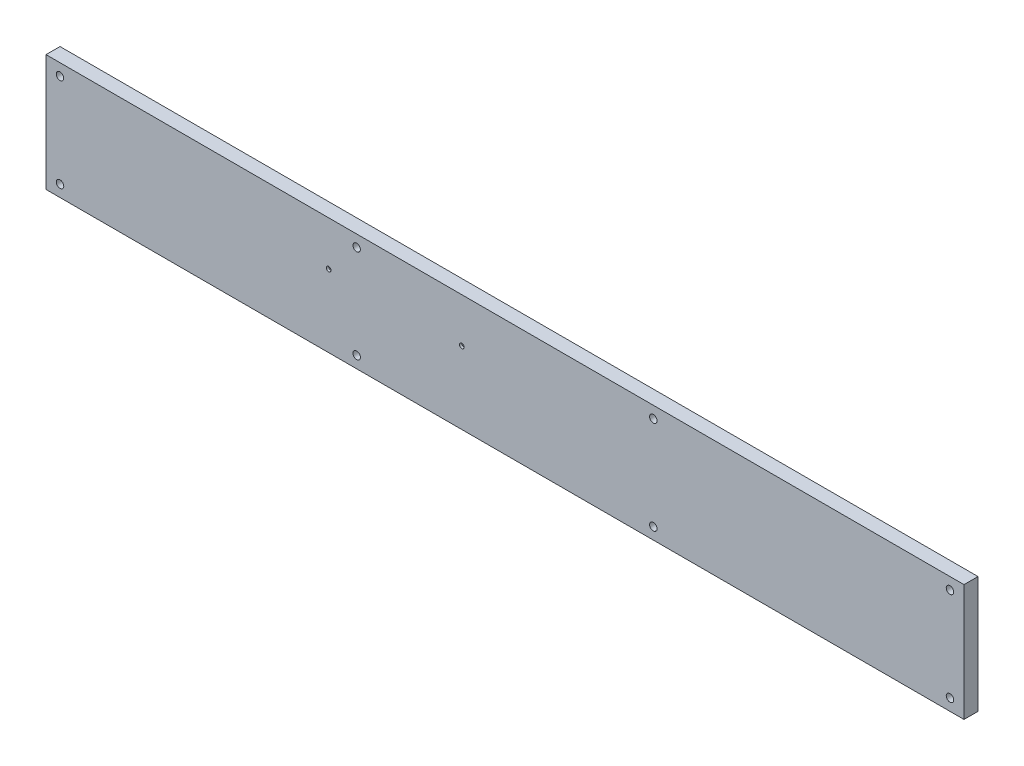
from build123d import *

# Parameters (mm, degrees)
ESQUISSE1_W             = 393
ESQUISSE1_H             = 50
ESQUISSE1_R             = 1.6
EXTRUSION1_DEPTH        = 6
ESQUISSE2_R             = 1
ENL_V_MAT_EXTRU_1_DEPTH = 1


with BuildPart() as part:
    # Esquisse1 → Extrusion1 (new body)
    with BuildSketch(Plane.XY):
        with Locations((196.5, 25)):
            Rectangle(ESQUISSE1_W, ESQUISSE1_H)
        with Locations((6, 5)):
            Circle(ESQUISSE1_R, mode=Mode.SUBTRACT)
        with Locations((133, 5)):
            Circle(ESQUISSE1_R, mode=Mode.SUBTRACT)
        with Locations((260, 5)):
            Circle(ESQUISSE1_R, mode=Mode.SUBTRACT)
        with Locations((387, 5)):
            Circle(ESQUISSE1_R, mode=Mode.SUBTRACT)
        with Locations(Location((6, 45, 0), (0, 0, 180))):
            Circle(ESQUISSE1_R, mode=Mode.SUBTRACT)
        with Locations(Location((133, 45, 0), (0, 0, 180))):
            Circle(ESQUISSE1_R, mode=Mode.SUBTRACT)
        with Locations(Location((260, 45, 0), (0, 0, 180))):
            Circle(ESQUISSE1_R, mode=Mode.SUBTRACT)
        with Locations(Location((387, 45, 0), (0, 0, 180))):
            Circle(ESQUISSE1_R, mode=Mode.SUBTRACT)
    extrude(amount=EXTRUSION1_DEPTH)

    # Esquisse2 → Enl_v. mat.-Extru.1 (cut)
    with BuildSketch(Plane.XY.offset(6)):
        with Locations((121, 31)):
            Circle(ESQUISSE2_R)
        with Locations((178, 31)):
            Circle(ESQUISSE2_R)
    extrude(amount=-ENL_V_MAT_EXTRU_1_DEPTH, mode=Mode.SUBTRACT)


solid = part.part
